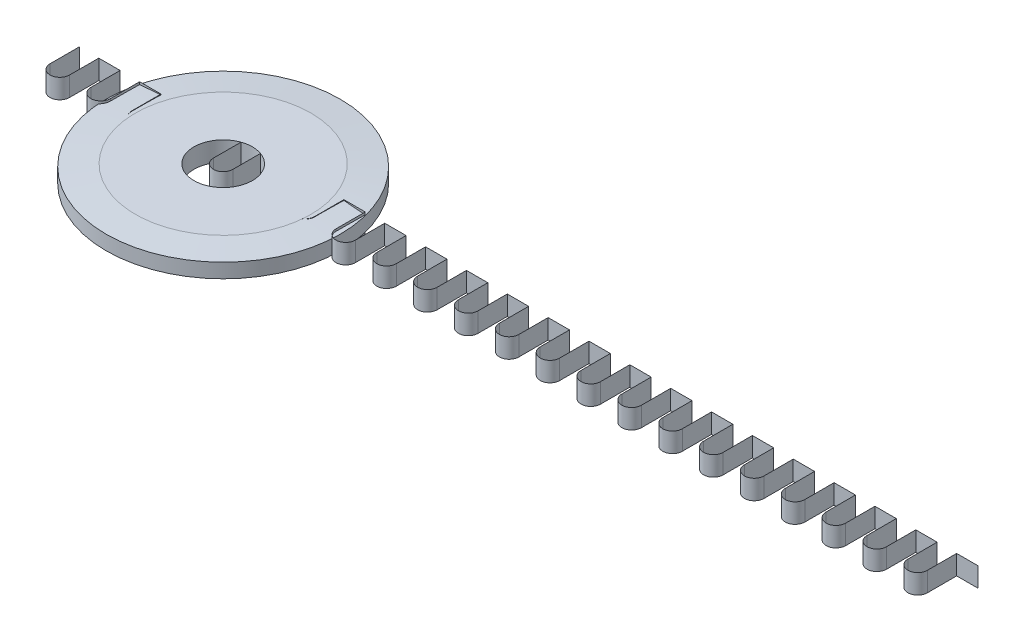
from build123d import *


with BuildPart() as part:
    # Skizze1 → Rotation1 (revolve)
    with BuildSketch(Plane.XY, mode=Mode.PRIVATE) as rotation1_sk:
        Polygon((15, 0), (45, 0), (60, 1.312329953), (60, 8.687670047), (45, 10), (15, 10), align=None)
    revolve(rotation1_sk.sketch.rotate(Axis((0, 0, 0), (0, 1, 0)), 90), axis=Axis((0, 0, 0), (0, 1, 0)))


solid = part.part
